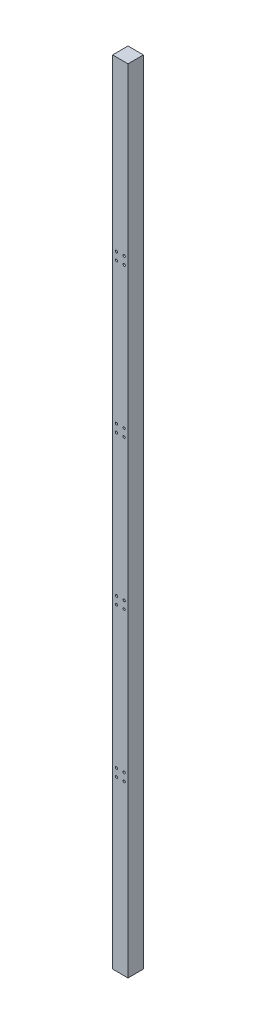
from build123d import *

# Parameters (mm, degrees)
SKETCH_1_W                   = 60
SKETCH_1_H                   = 60
EXTRUDE_1_DEPTH              = 3080
HOLE_WIZARD_M8_1_D           = 9
HOLE_WIZARD_M8_1_CBORE_D     = 15
HOLE_WIZARD_M8_1_CBORE_DEPTH = 6


with BuildPart() as part:
    # Sketch 1 → Extrude 1 (new body)
    with BuildSketch(Plane(origin=(0, 0, 0), x_dir=(1, 0, 0), z_dir=(0, 1, 0))):
        Rectangle(SKETCH_1_W, SKETCH_1_H)
    extrude(amount=EXTRUDE_1_DEPTH)

    # Hole Wizard M8 _1 (through all)
    with Locations(Plane(origin=(0, 0, -30), x_dir=(-1, 0, 0), z_dir=(0, 0, -1))):
        with Locations((15, 655), (-15, 655), (-15, 685), (15, 685), (15, 1235), (-15, 1235), (-15, 1265), (15, 1265), (15, 1815), (-15, 1815), (-15, 1845), (15, 1845), (15, 2395), (-15, 2395), (-15, 2425), (15, 2425)):
            CounterBoreHole(HOLE_WIZARD_M8_1_D / 2, HOLE_WIZARD_M8_1_CBORE_D / 2, HOLE_WIZARD_M8_1_CBORE_DEPTH)


solid = part.part
